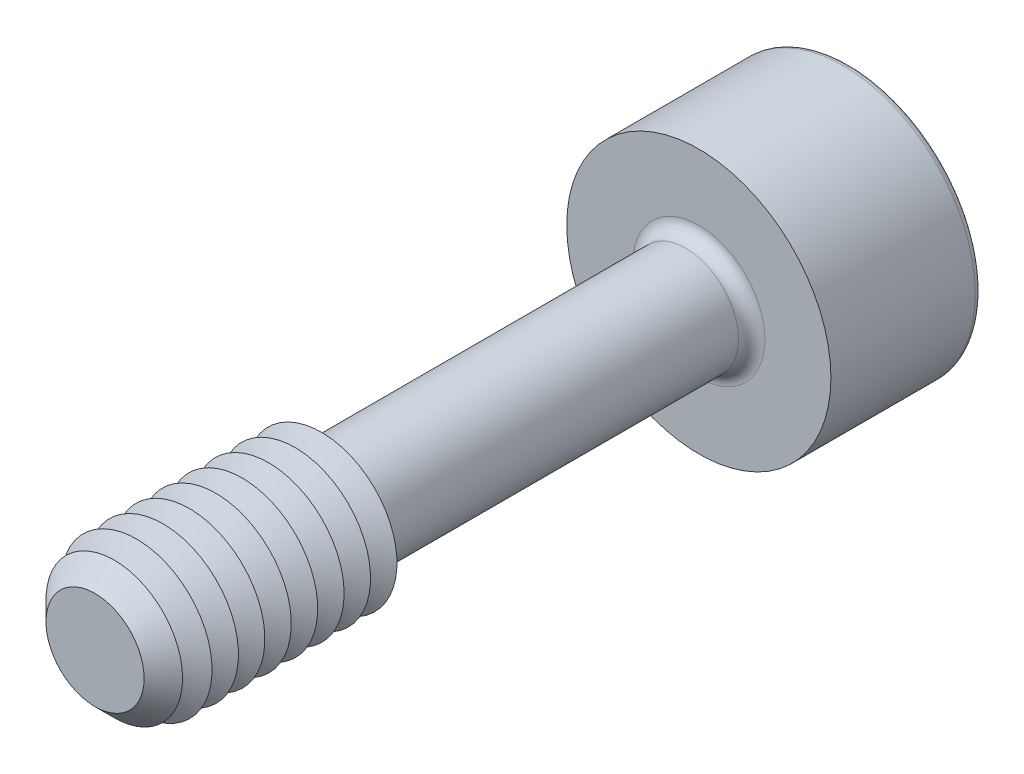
ISO-10303-21;
HEADER;
FILE_DESCRIPTION(('STEP AP214'),'2;1');
FILE_NAME('part.step','',(''),(''),'','','');
FILE_SCHEMA(('AUTOMOTIVE_DESIGN { 1 0 10303 214 1 1 1 1 }'));
ENDSEC;
DATA;
#1=APPLICATION_CONTEXT('core data for automotive mechanical design processes');
#2=APPLICATION_PROTOCOL_DEFINITION('international standard','automotive_design',2000,#1);
#3=PRODUCT_CONTEXT('',#1,'mechanical');
#4=PRODUCT('Part','Part','',(#3));
#5=PRODUCT_RELATED_PRODUCT_CATEGORY('part','',(#4));
#6=PRODUCT_DEFINITION_FORMATION('','',#4);
#7=PRODUCT_DEFINITION_CONTEXT('part definition',#1,'design');
#8=PRODUCT_DEFINITION('design','',#6,#7);
#9=PRODUCT_DEFINITION_SHAPE('','',#8);
#10=(LENGTH_UNIT() NAMED_UNIT(*) SI_UNIT(.MILLI.,.METRE.));
#11=(NAMED_UNIT(*) PLANE_ANGLE_UNIT() SI_UNIT($,.RADIAN.));
#12=(NAMED_UNIT(*) SI_UNIT($,.STERADIAN.) SOLID_ANGLE_UNIT());
#13=UNCERTAINTY_MEASURE_WITH_UNIT(LENGTH_MEASURE(1.E-05),#10,'distance_accuracy_value','');
#14=(GEOMETRIC_REPRESENTATION_CONTEXT(3) GLOBAL_UNCERTAINTY_ASSIGNED_CONTEXT((#13)) GLOBAL_UNIT_ASSIGNED_CONTEXT((#10,
#11,#12)) REPRESENTATION_CONTEXT('',''));
#15=CARTESIAN_POINT('',(0.,0.,0.));
#16=DIRECTION('',(0.,0.,1.));
#17=DIRECTION('',(1.,0.,0.));
#18=AXIS2_PLACEMENT_3D('',#15,#16,#17);
#19=CARTESIAN_POINT('',(-0.866025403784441,-1.5,-9.));
#20=DIRECTION('',(0.,0.,1.));
#21=DIRECTION('',(1.,0.,0.));
#22=AXIS2_PLACEMENT_3D('',#19,#20,#21);
#23=PLANE('',#22);
#24=DIRECTION('',(1.,0.,0.));
#25=VECTOR('',#24,1.);
#26=CARTESIAN_POINT('',(-0.866025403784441,-1.5,-9.));
#27=LINE('',#26,#25);
#28=CARTESIAN_POINT('',(0.,-1.5,-9.));
#29=VERTEX_POINT('',#28);
#30=CARTESIAN_POINT('',(0.866025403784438,-1.5,-9.));
#31=VERTEX_POINT('',#30);
#32=EDGE_CURVE('E762',#29,#31,#27,.T.);
#33=ORIENTED_EDGE('',*,*,#32,.F.);
#34=CARTESIAN_POINT('',(0.,0.,-9.));
#35=DIRECTION('',(0.,0.,1.));
#36=DIRECTION('',(0.,-1.,0.));
#37=AXIS2_PLACEMENT_3D('',#34,#35,#36);
#38=CIRCLE('',#37,1.5);
#39=CARTESIAN_POINT('',(1.29903810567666,-0.75,-9.));
#40=VERTEX_POINT('',#39);
#41=EDGE_CURVE('E53',#29,#40,#38,.T.);
#42=ORIENTED_EDGE('',*,*,#41,.T.);
#43=DIRECTION('',(0.5,0.866025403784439,0.));
#44=VECTOR('',#43,1.);
#45=CARTESIAN_POINT('',(0.866025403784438,-1.5,-9.));
#46=LINE('',#45,#44);
#47=EDGE_CURVE('E749',#31,#40,#46,.T.);
#48=ORIENTED_EDGE('',*,*,#47,.F.);
#49=EDGE_LOOP('',(#33,#42,#48));
#50=FACE_BOUND('',#49,.T.);
#51=ADVANCED_FACE('F41',(#50),#23,.F.);
#52=CARTESIAN_POINT('',(1.73205080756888,0.,-9.));
#53=VERTEX_POINT('',#52);
#54=EDGE_CURVE('E759',#40,#53,#46,.T.);
#55=ORIENTED_EDGE('',*,*,#54,.F.);
#56=CARTESIAN_POINT('',(1.29903810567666,0.749999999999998,-9.));
#57=VERTEX_POINT('',#56);
#58=EDGE_CURVE('E11',#40,#57,#38,.T.);
#59=ORIENTED_EDGE('',*,*,#58,.T.);
#60=DIRECTION('',(-0.5,0.866025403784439,0.));
#61=VECTOR('',#60,1.);
#62=CARTESIAN_POINT('',(1.73205080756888,0.,-9.));
#63=LINE('',#62,#61);
#64=EDGE_CURVE('E748',#53,#57,#63,.T.);
#65=ORIENTED_EDGE('',*,*,#64,.F.);
#66=EDGE_LOOP('',(#55,#59,#65));
#67=FACE_BOUND('',#66,.T.);
#68=ADVANCED_FACE('F133',(#67),#23,.F.);
#69=CARTESIAN_POINT('',(0.866025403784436,1.5,-9.));
#70=VERTEX_POINT('',#69);
#71=EDGE_CURVE('E743',#57,#70,#63,.T.);
#72=ORIENTED_EDGE('',*,*,#71,.F.);
#73=CARTESIAN_POINT('',(0.,1.5,-9.00000000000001));
#74=VERTEX_POINT('',#73);
#75=EDGE_CURVE('E51',#57,#74,#38,.T.);
#76=ORIENTED_EDGE('',*,*,#75,.T.);
#77=DIRECTION('',(-1.,0.,0.));
#78=VECTOR('',#77,1.);
#79=CARTESIAN_POINT('',(0.866025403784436,1.5,-9.));
#80=LINE('',#79,#78);
#81=EDGE_CURVE('E177',#70,#74,#80,.T.);
#82=ORIENTED_EDGE('',*,*,#81,.F.);
#83=EDGE_LOOP('',(#72,#76,#82));
#84=FACE_BOUND('',#83,.T.);
#85=ADVANCED_FACE('F139',(#84),#23,.F.);
#86=CARTESIAN_POINT('',(-0.866025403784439,1.5,-9.));
#87=VERTEX_POINT('',#86);
#88=EDGE_CURVE('E753',#74,#87,#80,.T.);
#89=ORIENTED_EDGE('',*,*,#88,.F.);
#90=CARTESIAN_POINT('',(-1.29903810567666,0.749999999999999,-9.));
#91=VERTEX_POINT('',#90);
#92=EDGE_CURVE('E266',#74,#91,#38,.T.);
#93=ORIENTED_EDGE('',*,*,#92,.T.);
#94=DIRECTION('',(-0.5,-0.866025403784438,0.));
#95=VECTOR('',#94,1.);
#96=CARTESIAN_POINT('',(-0.866025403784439,1.5,-9.));
#97=LINE('',#96,#95);
#98=EDGE_CURVE('E176',#87,#91,#97,.T.);
#99=ORIENTED_EDGE('',*,*,#98,.F.);
#100=EDGE_LOOP('',(#89,#93,#99));
#101=FACE_BOUND('',#100,.T.);
#102=ADVANCED_FACE('F157',(#101),#23,.F.);
#103=CARTESIAN_POINT('',(-1.73205080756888,0.,-9.));
#104=VERTEX_POINT('',#103);
#105=EDGE_CURVE('E170',#91,#104,#97,.T.);
#106=ORIENTED_EDGE('',*,*,#105,.F.);
#107=CARTESIAN_POINT('',(-1.29903810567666,-0.749999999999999,-9.));
#108=VERTEX_POINT('',#107);
#109=EDGE_CURVE('E172',#91,#108,#38,.T.);
#110=ORIENTED_EDGE('',*,*,#109,.T.);
#111=DIRECTION('',(0.5,-0.866025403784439,0.));
#112=VECTOR('',#111,1.);
#113=CARTESIAN_POINT('',(-1.73205080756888,0.,-9.));
#114=LINE('',#113,#112);
#115=EDGE_CURVE('E174',#104,#108,#114,.T.);
#116=ORIENTED_EDGE('',*,*,#115,.F.);
#117=EDGE_LOOP('',(#106,#110,#116));
#118=FACE_BOUND('',#117,.T.);
#119=ADVANCED_FACE('F146',(#118),#23,.F.);
#120=CARTESIAN_POINT('',(0.,0.,-12.));
#121=DIRECTION('',(0.,0.,-1.));
#122=DIRECTION('',(-1.,0.,0.));
#123=AXIS2_PLACEMENT_3D('',#120,#121,#122);
#124=PLANE('',#123);
#125=CARTESIAN_POINT('',(0.,0.,-12.));
#126=DIRECTION('',(0.,0.,-1.));
#127=DIRECTION('',(-1.,0.,0.));
#128=AXIS2_PLACEMENT_3D('',#125,#126,#127);
#129=CIRCLE('',#128,3.325);
#130=CARTESIAN_POINT('',(-3.325,0.,-12.));
#131=VERTEX_POINT('',#130);
#132=EDGE_CURVE('E250',#131,#131,#129,.T.);
#133=ORIENTED_EDGE('',*,*,#132,.T.);
#134=EDGE_LOOP('',(#133));
#135=FACE_BOUND('',#134,.T.);
#136=DIRECTION('',(-0.5,-0.866025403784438,0.));
#137=VECTOR('',#136,1.);
#138=CARTESIAN_POINT('',(-0.866025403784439,1.5,-12.));
#139=LINE('',#138,#137);
#140=CARTESIAN_POINT('',(-0.866025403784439,1.5,-12.));
#141=VERTEX_POINT('',#140);
#142=CARTESIAN_POINT('',(-1.73205080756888,0.,-12.));
#143=VERTEX_POINT('',#142);
#144=EDGE_CURVE('E212',#141,#143,#139,.T.);
#145=ORIENTED_EDGE('',*,*,#144,.T.);
#146=DIRECTION('',(0.5,-0.866025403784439,0.));
#147=VECTOR('',#146,1.);
#148=CARTESIAN_POINT('',(-1.73205080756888,0.,-12.));
#149=LINE('',#148,#147);
#150=CARTESIAN_POINT('',(-0.866025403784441,-1.5,-12.));
#151=VERTEX_POINT('',#150);
#152=EDGE_CURVE('E67',#143,#151,#149,.T.);
#153=ORIENTED_EDGE('',*,*,#152,.T.);
#154=DIRECTION('',(1.,0.,0.));
#155=VECTOR('',#154,1.);
#156=CARTESIAN_POINT('',(-0.866025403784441,-1.5,-12.));
#157=LINE('',#156,#155);
#158=CARTESIAN_POINT('',(0.866025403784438,-1.5,-12.));
#159=VERTEX_POINT('',#158);
#160=EDGE_CURVE('E196',#151,#159,#157,.T.);
#161=ORIENTED_EDGE('',*,*,#160,.T.);
#162=DIRECTION('',(0.5,0.866025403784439,0.));
#163=VECTOR('',#162,1.);
#164=CARTESIAN_POINT('',(0.866025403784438,-1.5,-12.));
#165=LINE('',#164,#163);
#166=CARTESIAN_POINT('',(1.73205080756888,0.,-12.));
#167=VERTEX_POINT('',#166);
#168=EDGE_CURVE('E200',#159,#167,#165,.T.);
#169=ORIENTED_EDGE('',*,*,#168,.T.);
#170=DIRECTION('',(-0.5,0.866025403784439,0.));
#171=VECTOR('',#170,1.);
#172=CARTESIAN_POINT('',(1.73205080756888,0.,-12.));
#173=LINE('',#172,#171);
#174=CARTESIAN_POINT('',(0.866025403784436,1.5,-12.));
#175=VERTEX_POINT('',#174);
#176=EDGE_CURVE('E204',#167,#175,#173,.T.);
#177=ORIENTED_EDGE('',*,*,#176,.T.);
#178=DIRECTION('',(-1.,0.,0.));
#179=VECTOR('',#178,1.);
#180=CARTESIAN_POINT('',(0.866025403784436,1.5,-12.));
#181=LINE('',#180,#179);
#182=EDGE_CURVE('E208',#175,#141,#181,.T.);
#183=ORIENTED_EDGE('',*,*,#182,.T.);
#184=EDGE_LOOP('',(#145,#153,#161,#169,#177,#183));
#185=FACE_BOUND('',#184,.T.);
#186=ADVANCED_FACE('F156',(#135,#185),#124,.T.);
#187=CARTESIAN_POINT('',(0.,0.,8.));
#188=DIRECTION('',(0.,0.,-1.));
#189=DIRECTION('',(-1.,0.,0.));
#190=AXIS2_PLACEMENT_3D('',#187,#188,#189);
#191=CYLINDRICAL_SURFACE('',#190,1.4);
#192=CARTESIAN_POINT('',(0.,0.,-7.65));
#193=DIRECTION('',(0.,0.,-1.));
#194=DIRECTION('',(-1.,0.,0.));
#195=AXIS2_PLACEMENT_3D('',#192,#193,#194);
#196=CIRCLE('',#195,1.4);
#197=CARTESIAN_POINT('',(-1.4,0.,-7.65));
#198=VERTEX_POINT('',#197);
#199=EDGE_CURVE('E246',#198,#198,#196,.F.);
#200=ORIENTED_EDGE('',*,*,#199,.T.);
#201=EDGE_LOOP('',(#200));
#202=FACE_BOUND('',#201,.T.);
#203=CARTESIAN_POINT('',(0.,0.,1.65358983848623));
#204=DIRECTION('',(0.,0.,-1.));
#205=DIRECTION('',(0.,1.,0.));
#206=AXIS2_PLACEMENT_3D('',#203,#204,#205);
#207=CIRCLE('',#206,1.4);
#208=CARTESIAN_POINT('',(0.,1.4,1.65358983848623));
#209=VERTEX_POINT('',#208);
#210=EDGE_CURVE('E234',#209,#209,#207,.T.);
#211=ORIENTED_EDGE('',*,*,#210,.T.);
#212=EDGE_LOOP('',(#211));
#213=FACE_BOUND('',#212,.T.);
#214=ADVANCED_FACE('F163',(#202,#213),#191,.T.);
#215=CARTESIAN_POINT('',(0.,0.,1.65358983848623));
#216=DIRECTION('',(0.,0.,1.));
#217=DIRECTION('',(0.,-1.,0.));
#218=AXIS2_PLACEMENT_3D('',#215,#216,#217);
#219=CONICAL_SURFACE('',#218,1.4,1.0471975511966);
#220=CARTESIAN_POINT('',(0.,0.,2.));
#221=DIRECTION('',(0.,0.,-1.));
#222=DIRECTION('',(-1.,0.,0.));
#223=AXIS2_PLACEMENT_3D('',#220,#221,#222);
#224=CIRCLE('',#223,2.);
#225=CARTESIAN_POINT('',(-2.,0.,2.));
#226=VERTEX_POINT('',#225);
#227=EDGE_CURVE('E270',#226,#226,#224,.T.);
#228=ORIENTED_EDGE('',*,*,#227,.T.);
#229=EDGE_LOOP('',(#228));
#230=FACE_BOUND('',#229,.T.);
#231=ORIENTED_EDGE('',*,*,#210,.F.);
#232=EDGE_LOOP('',(#231));
#233=FACE_BOUND('',#232,.T.);
#234=ADVANCED_FACE('F512',(#230,#233),#219,.T.);
#235=CARTESIAN_POINT('',(0.,0.,-8.));
#236=DIRECTION('',(0.,0.,-1.));
#237=DIRECTION('',(-1.,0.,0.));
#238=AXIS2_PLACEMENT_3D('',#235,#236,#237);
#239=PLANE('',#238);
#240=CARTESIAN_POINT('',(0.,0.,-8.));
#241=DIRECTION('',(0.,0.,-1.));
#242=DIRECTION('',(-1.,0.,0.));
#243=AXIS2_PLACEMENT_3D('',#240,#241,#242);
#244=CIRCLE('',#243,1.75);
#245=CARTESIAN_POINT('',(-1.75,0.,-8.));
#246=VERTEX_POINT('',#245);
#247=EDGE_CURVE('E242',#246,#246,#244,.T.);
#248=ORIENTED_EDGE('',*,*,#247,.T.);
#249=EDGE_LOOP('',(#248));
#250=FACE_BOUND('',#249,.T.);
#251=CARTESIAN_POINT('',(0.,0.,-8.));
#252=DIRECTION('',(0.,0.,-1.));
#253=DIRECTION('',(-1.,0.,0.));
#254=AXIS2_PLACEMENT_3D('',#251,#252,#253);
#255=CIRCLE('',#254,3.5);
#256=CARTESIAN_POINT('',(-3.5,0.,-8.));
#257=VERTEX_POINT('',#256);
#258=EDGE_CURVE('E230',#257,#257,#255,.T.);
#259=ORIENTED_EDGE('',*,*,#258,.F.);
#260=EDGE_LOOP('',(#259));
#261=FACE_BOUND('',#260,.T.);
#262=ADVANCED_FACE('F505',(#250,#261),#239,.F.);
#263=CARTESIAN_POINT('',(0.,0.,-12.));
#264=DIRECTION('',(0.,0.,1.));
#265=DIRECTION('',(1.,0.,0.));
#266=AXIS2_PLACEMENT_3D('',#263,#264,#265);
#267=CYLINDRICAL_SURFACE('',#266,3.5);
#268=CARTESIAN_POINT('',(0.,0.,-11.825));
#269=DIRECTION('',(0.,0.,-1.));
#270=DIRECTION('',(-1.,0.,0.));
#271=AXIS2_PLACEMENT_3D('',#268,#269,#270);
#272=CIRCLE('',#271,3.5);
#273=CARTESIAN_POINT('',(-3.5,0.,-11.825));
#274=VERTEX_POINT('',#273);
#275=EDGE_CURVE('E253',#274,#274,#272,.F.);
#276=ORIENTED_EDGE('',*,*,#275,.T.);
#277=EDGE_LOOP('',(#276));
#278=FACE_BOUND('',#277,.T.);
#279=ORIENTED_EDGE('',*,*,#258,.T.);
#280=EDGE_LOOP('',(#279));
#281=FACE_BOUND('',#280,.T.);
#282=ADVANCED_FACE('F511',(#278,#281),#267,.T.);
#283=CARTESIAN_POINT('',(-1.73205080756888,0.,-9.));
#284=DIRECTION('',(0.866025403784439,0.5,0.));
#285=DIRECTION('',(-0.5,0.866025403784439,0.));
#286=AXIS2_PLACEMENT_3D('',#283,#284,#285);
#287=PLANE('',#286);
#288=ORIENTED_EDGE('',*,*,#152,.F.);
#289=DIRECTION('',(0.,0.,-1.));
#290=VECTOR('',#289,1.);
#291=CARTESIAN_POINT('',(-1.73205080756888,0.,-9.));
#292=LINE('',#291,#290);
#293=EDGE_CURVE('E186',#104,#143,#292,.T.);
#294=ORIENTED_EDGE('',*,*,#293,.F.);
#295=ORIENTED_EDGE('',*,*,#115,.T.);
#296=CARTESIAN_POINT('',(-0.866025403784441,-1.5,-9.));
#297=VERTEX_POINT('',#296);
#298=EDGE_CURVE('E215',#108,#297,#114,.T.);
#299=ORIENTED_EDGE('',*,*,#298,.T.);
#300=DIRECTION('',(0.,0.,-1.));
#301=VECTOR('',#300,1.);
#302=CARTESIAN_POINT('',(-0.866025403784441,-1.5,-9.));
#303=LINE('',#302,#301);
#304=EDGE_CURVE('E227',#297,#151,#303,.T.);
#305=ORIENTED_EDGE('',*,*,#304,.T.);
#306=EDGE_LOOP('',(#288,#294,#295,#299,#305));
#307=FACE_BOUND('',#306,.T.);
#308=ADVANCED_FACE('F523',(#307),#287,.T.);
#309=CARTESIAN_POINT('',(-0.866025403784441,-1.5,-9.));
#310=DIRECTION('',(0.,1.,0.));
#311=DIRECTION('',(0.,0.,1.));
#312=AXIS2_PLACEMENT_3D('',#309,#310,#311);
#313=PLANE('',#312);
#314=ORIENTED_EDGE('',*,*,#160,.F.);
#315=ORIENTED_EDGE('',*,*,#304,.F.);
#316=EDGE_CURVE('E760',#297,#29,#27,.T.);
#317=ORIENTED_EDGE('',*,*,#316,.T.);
#318=ORIENTED_EDGE('',*,*,#32,.T.);
#319=DIRECTION('',(0.,0.,-1.));
#320=VECTOR('',#319,1.);
#321=CARTESIAN_POINT('',(0.866025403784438,-1.5,-9.));
#322=LINE('',#321,#320);
#323=EDGE_CURVE('E224',#31,#159,#322,.T.);
#324=ORIENTED_EDGE('',*,*,#323,.T.);
#325=EDGE_LOOP('',(#314,#315,#317,#318,#324));
#326=FACE_BOUND('',#325,.T.);
#327=ADVANCED_FACE('F539',(#326),#313,.T.);
#328=CARTESIAN_POINT('',(0.866025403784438,-1.5,-9.));
#329=DIRECTION('',(-0.866025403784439,0.5,0.));
#330=DIRECTION('',(-0.5,-0.866025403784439,0.));
#331=AXIS2_PLACEMENT_3D('',#328,#329,#330);
#332=PLANE('',#331);
#333=ORIENTED_EDGE('',*,*,#168,.F.);
#334=ORIENTED_EDGE('',*,*,#323,.F.);
#335=ORIENTED_EDGE('',*,*,#47,.T.);
#336=ORIENTED_EDGE('',*,*,#54,.T.);
#337=DIRECTION('',(0.,0.,-1.));
#338=VECTOR('',#337,1.);
#339=CARTESIAN_POINT('',(1.73205080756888,0.,-9.));
#340=LINE('',#339,#338);
#341=EDGE_CURVE('E221',#53,#167,#340,.T.);
#342=ORIENTED_EDGE('',*,*,#341,.T.);
#343=EDGE_LOOP('',(#333,#334,#335,#336,#342));
#344=FACE_BOUND('',#343,.T.);
#345=ADVANCED_FACE('F549',(#344),#332,.T.);
#346=CARTESIAN_POINT('',(1.73205080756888,0.,-9.));
#347=DIRECTION('',(-0.866025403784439,-0.5,0.));
#348=DIRECTION('',(0.5,-0.866025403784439,0.));
#349=AXIS2_PLACEMENT_3D('',#346,#347,#348);
#350=PLANE('',#349);
#351=ORIENTED_EDGE('',*,*,#176,.F.);
#352=ORIENTED_EDGE('',*,*,#341,.F.);
#353=ORIENTED_EDGE('',*,*,#64,.T.);
#354=ORIENTED_EDGE('',*,*,#71,.T.);
#355=DIRECTION('',(0.,0.,-1.));
#356=VECTOR('',#355,1.);
#357=CARTESIAN_POINT('',(0.866025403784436,1.5,-9.));
#358=LINE('',#357,#356);
#359=EDGE_CURVE('E218',#70,#175,#358,.T.);
#360=ORIENTED_EDGE('',*,*,#359,.T.);
#361=EDGE_LOOP('',(#351,#352,#353,#354,#360));
#362=FACE_BOUND('',#361,.T.);
#363=ADVANCED_FACE('F559',(#362),#350,.T.);
#364=CARTESIAN_POINT('',(0.866025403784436,1.5,-9.));
#365=DIRECTION('',(0.,-1.,0.));
#366=DIRECTION('',(0.,0.,-1.));
#367=AXIS2_PLACEMENT_3D('',#364,#365,#366);
#368=PLANE('',#367);
#369=ORIENTED_EDGE('',*,*,#182,.F.);
#370=ORIENTED_EDGE('',*,*,#359,.F.);
#371=ORIENTED_EDGE('',*,*,#81,.T.);
#372=ORIENTED_EDGE('',*,*,#88,.T.);
#373=DIRECTION('',(0.,0.,-1.));
#374=VECTOR('',#373,1.);
#375=CARTESIAN_POINT('',(-0.866025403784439,1.5,-9.));
#376=LINE('',#375,#374);
#377=EDGE_CURVE('E182',#87,#141,#376,.T.);
#378=ORIENTED_EDGE('',*,*,#377,.T.);
#379=EDGE_LOOP('',(#369,#370,#371,#372,#378));
#380=FACE_BOUND('',#379,.T.);
#381=ADVANCED_FACE('F152',(#380),#368,.T.);
#382=CARTESIAN_POINT('',(-0.866025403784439,1.5,-9.));
#383=DIRECTION('',(0.866025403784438,-0.5,0.));
#384=DIRECTION('',(0.5,0.866025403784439,0.));
#385=AXIS2_PLACEMENT_3D('',#382,#383,#384);
#386=PLANE('',#385);
#387=ORIENTED_EDGE('',*,*,#144,.F.);
#388=ORIENTED_EDGE('',*,*,#377,.F.);
#389=ORIENTED_EDGE('',*,*,#98,.T.);
#390=ORIENTED_EDGE('',*,*,#105,.T.);
#391=ORIENTED_EDGE('',*,*,#293,.T.);
#392=EDGE_LOOP('',(#387,#388,#389,#390,#391));
#393=FACE_BOUND('',#392,.T.);
#394=ADVANCED_FACE('F144',(#393),#386,.T.);
#395=ORIENTED_EDGE('',*,*,#298,.F.);
#396=EDGE_CURVE('E256',#108,#29,#38,.T.);
#397=ORIENTED_EDGE('',*,*,#396,.T.);
#398=ORIENTED_EDGE('',*,*,#316,.F.);
#399=EDGE_LOOP('',(#395,#397,#398));
#400=FACE_BOUND('',#399,.T.);
#401=ADVANCED_FACE('F135',(#400),#23,.F.);
#402=CARTESIAN_POINT('',(0.,0.,-7.65));
#403=DIRECTION('',(0.,0.,-1.));
#404=DIRECTION('',(-1.,0.,0.));
#405=AXIS2_PLACEMENT_3D('',#402,#403,#404);
#406=TOROIDAL_SURFACE('',#405,1.75,0.35);
#407=ORIENTED_EDGE('',*,*,#199,.F.);
#408=EDGE_LOOP('',(#407));
#409=FACE_BOUND('',#408,.T.);
#410=ORIENTED_EDGE('',*,*,#247,.F.);
#411=EDGE_LOOP('',(#410));
#412=FACE_BOUND('',#411,.T.);
#413=ADVANCED_FACE('F129',(#409,#412),#406,.F.);
#414=CARTESIAN_POINT('',(0.,0.,-11.825));
#415=DIRECTION('',(0.,0.,-1.));
#416=DIRECTION('',(-1.,0.,0.));
#417=AXIS2_PLACEMENT_3D('',#414,#415,#416);
#418=TOROIDAL_SURFACE('',#417,3.325,0.175);
#419=ORIENTED_EDGE('',*,*,#275,.F.);
#420=EDGE_LOOP('',(#419));
#421=FACE_BOUND('',#420,.T.);
#422=ORIENTED_EDGE('',*,*,#132,.F.);
#423=EDGE_LOOP('',(#422));
#424=FACE_BOUND('',#423,.T.);
#425=ADVANCED_FACE('F43',(#421,#424),#418,.T.);
#426=CARTESIAN_POINT('',(0.,0.,-8.13397459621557));
#427=DIRECTION('',(0.,0.,-1.));
#428=DIRECTION('',(0.,1.,0.));
#429=AXIS2_PLACEMENT_3D('',#426,#427,#428);
#430=CONICAL_SURFACE('',#429,0.,1.0471975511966);
#431=ORIENTED_EDGE('',*,*,#41,.F.);
#432=ORIENTED_EDGE('',*,*,#396,.F.);
#433=ORIENTED_EDGE('',*,*,#109,.F.);
#434=ORIENTED_EDGE('',*,*,#92,.F.);
#435=ORIENTED_EDGE('',*,*,#75,.F.);
#436=ORIENTED_EDGE('',*,*,#58,.F.);
#437=EDGE_LOOP('',(#431,#432,#433,#434,#435,#436));
#438=FACE_BOUND('',#437,.T.);
#439=CARTESIAN_POINT('',(0.,0.,-8.13397459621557));
#440=VERTEX_POINT('',#439);
#441=VERTEX_LOOP('',#440);
#442=FACE_BOUND('',#441,.T.);
#443=ADVANCED_FACE('F118',(#438,#442),#430,.F.);
#444=CARTESIAN_POINT('',(0.,0.,2.35));
#445=DIRECTION('',(0.,0.,-1.));
#446=DIRECTION('',(-1.,0.,0.));
#447=AXIS2_PLACEMENT_3D('',#444,#445,#446);
#448=CONICAL_SURFACE('',#447,1.39378221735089,1.0471975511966);
#449=ORIENTED_EDGE('',*,*,#227,.F.);
#450=EDGE_LOOP('',(#449));
#451=FACE_BOUND('',#450,.T.);
#452=CARTESIAN_POINT('',(0.,0.,2.35));
#453=DIRECTION('',(0.,0.,-1.));
#454=DIRECTION('',(-1.,0.,0.));
#455=AXIS2_PLACEMENT_3D('',#452,#453,#454);
#456=CIRCLE('',#455,1.39378221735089);
#457=CARTESIAN_POINT('',(-1.39378221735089,0.,2.35));
#458=VERTEX_POINT('',#457);
#459=EDGE_CURVE('E277',#458,#458,#456,.T.);
#460=ORIENTED_EDGE('',*,*,#459,.T.);
#461=EDGE_LOOP('',(#460));
#462=FACE_BOUND('',#461,.T.);
#463=ADVANCED_FACE('F120',(#451,#462),#448,.T.);
#464=CARTESIAN_POINT('',(0.,0.,2.7));
#465=DIRECTION('',(0.,0.,1.));
#466=DIRECTION('',(1.,0.,0.));
#467=AXIS2_PLACEMENT_3D('',#464,#465,#466);
#468=CONICAL_SURFACE('',#467,2.,1.0471975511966);
#469=ORIENTED_EDGE('',*,*,#459,.F.);
#470=EDGE_LOOP('',(#469));
#471=FACE_BOUND('',#470,.T.);
#472=CARTESIAN_POINT('',(0.,0.,2.7));
#473=DIRECTION('',(0.,0.,-1.));
#474=DIRECTION('',(-1.,0.,0.));
#475=AXIS2_PLACEMENT_3D('',#472,#473,#474);
#476=CIRCLE('',#475,2.);
#477=CARTESIAN_POINT('',(-2.,0.,2.7));
#478=VERTEX_POINT('',#477);
#479=EDGE_CURVE('E283',#478,#478,#476,.T.);
#480=ORIENTED_EDGE('',*,*,#479,.T.);
#481=EDGE_LOOP('',(#480));
#482=FACE_BOUND('',#481,.T.);
#483=ADVANCED_FACE('F126',(#471,#482),#468,.T.);
#484=CARTESIAN_POINT('',(0.,0.,3.05));
#485=DIRECTION('',(0.,0.,-1.));
#486=DIRECTION('',(-1.,0.,0.));
#487=AXIS2_PLACEMENT_3D('',#484,#485,#486);
#488=CONICAL_SURFACE('',#487,1.39378221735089,1.0471975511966);
#489=ORIENTED_EDGE('',*,*,#479,.F.);
#490=EDGE_LOOP('',(#489));
#491=FACE_BOUND('',#490,.T.);
#492=CARTESIAN_POINT('',(0.,0.,3.05));
#493=DIRECTION('',(0.,0.,-1.));
#494=DIRECTION('',(-1.,0.,0.));
#495=AXIS2_PLACEMENT_3D('',#492,#493,#494);
#496=CIRCLE('',#495,1.39378221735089);
#497=CARTESIAN_POINT('',(-1.39378221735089,0.,3.05));
#498=VERTEX_POINT('',#497);
#499=EDGE_CURVE('E289',#498,#498,#496,.T.);
#500=ORIENTED_EDGE('',*,*,#499,.T.);
#501=EDGE_LOOP('',(#500));
#502=FACE_BOUND('',#501,.T.);
#503=ADVANCED_FACE('F399',(#491,#502),#488,.T.);
#504=CARTESIAN_POINT('',(0.,0.,3.4));
#505=DIRECTION('',(0.,0.,1.));
#506=DIRECTION('',(1.,0.,0.));
#507=AXIS2_PLACEMENT_3D('',#504,#505,#506);
#508=CONICAL_SURFACE('',#507,2.,1.0471975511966);
#509=ORIENTED_EDGE('',*,*,#499,.F.);
#510=EDGE_LOOP('',(#509));
#511=FACE_BOUND('',#510,.T.);
#512=CARTESIAN_POINT('',(0.,0.,3.4));
#513=DIRECTION('',(0.,0.,-1.));
#514=DIRECTION('',(-1.,0.,0.));
#515=AXIS2_PLACEMENT_3D('',#512,#513,#514);
#516=CIRCLE('',#515,2.);
#517=CARTESIAN_POINT('',(-2.,0.,3.4));
#518=VERTEX_POINT('',#517);
#519=EDGE_CURVE('E293',#518,#518,#516,.T.);
#520=ORIENTED_EDGE('',*,*,#519,.T.);
#521=EDGE_LOOP('',(#520));
#522=FACE_BOUND('',#521,.T.);
#523=ADVANCED_FACE('F395',(#511,#522),#508,.T.);
#524=CARTESIAN_POINT('',(0.,0.,3.75));
#525=DIRECTION('',(0.,0.,-1.));
#526=DIRECTION('',(-1.,0.,0.));
#527=AXIS2_PLACEMENT_3D('',#524,#525,#526);
#528=CONICAL_SURFACE('',#527,1.39378221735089,1.0471975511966);
#529=ORIENTED_EDGE('',*,*,#519,.F.);
#530=EDGE_LOOP('',(#529));
#531=FACE_BOUND('',#530,.T.);
#532=CARTESIAN_POINT('',(0.,0.,3.75));
#533=DIRECTION('',(0.,0.,-1.));
#534=DIRECTION('',(-1.,0.,0.));
#535=AXIS2_PLACEMENT_3D('',#532,#533,#534);
#536=CIRCLE('',#535,1.39378221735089);
#537=CARTESIAN_POINT('',(-1.39378221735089,0.,3.75));
#538=VERTEX_POINT('',#537);
#539=EDGE_CURVE('E297',#538,#538,#536,.T.);
#540=ORIENTED_EDGE('',*,*,#539,.T.);
#541=EDGE_LOOP('',(#540));
#542=FACE_BOUND('',#541,.T.);
#543=ADVANCED_FACE('F391',(#531,#542),#528,.T.);
#544=CARTESIAN_POINT('',(0.,0.,4.1));
#545=DIRECTION('',(0.,0.,1.));
#546=DIRECTION('',(1.,0.,0.));
#547=AXIS2_PLACEMENT_3D('',#544,#545,#546);
#548=CONICAL_SURFACE('',#547,2.,1.0471975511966);
#549=ORIENTED_EDGE('',*,*,#539,.F.);
#550=EDGE_LOOP('',(#549));
#551=FACE_BOUND('',#550,.T.);
#552=CARTESIAN_POINT('',(0.,0.,4.1));
#553=DIRECTION('',(0.,0.,-1.));
#554=DIRECTION('',(-1.,0.,0.));
#555=AXIS2_PLACEMENT_3D('',#552,#553,#554);
#556=CIRCLE('',#555,2.);
#557=CARTESIAN_POINT('',(-2.,0.,4.1));
#558=VERTEX_POINT('',#557);
#559=EDGE_CURVE('E300',#558,#558,#556,.T.);
#560=ORIENTED_EDGE('',*,*,#559,.T.);
#561=EDGE_LOOP('',(#560));
#562=FACE_BOUND('',#561,.T.);
#563=ADVANCED_FACE('F387',(#551,#562),#548,.T.);
#564=CARTESIAN_POINT('',(0.,0.,4.45));
#565=DIRECTION('',(0.,0.,-1.));
#566=DIRECTION('',(-1.,0.,0.));
#567=AXIS2_PLACEMENT_3D('',#564,#565,#566);
#568=CONICAL_SURFACE('',#567,1.39378221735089,1.0471975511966);
#569=ORIENTED_EDGE('',*,*,#559,.F.);
#570=EDGE_LOOP('',(#569));
#571=FACE_BOUND('',#570,.T.);
#572=CARTESIAN_POINT('',(0.,0.,4.45));
#573=DIRECTION('',(0.,0.,-1.));
#574=DIRECTION('',(-1.,0.,0.));
#575=AXIS2_PLACEMENT_3D('',#572,#573,#574);
#576=CIRCLE('',#575,1.39378221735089);
#577=CARTESIAN_POINT('',(-1.39378221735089,0.,4.45));
#578=VERTEX_POINT('',#577);
#579=EDGE_CURVE('E304',#578,#578,#576,.T.);
#580=ORIENTED_EDGE('',*,*,#579,.T.);
#581=EDGE_LOOP('',(#580));
#582=FACE_BOUND('',#581,.T.);
#583=ADVANCED_FACE('F383',(#571,#582),#568,.T.);
#584=CARTESIAN_POINT('',(0.,0.,4.8));
#585=DIRECTION('',(0.,0.,1.));
#586=DIRECTION('',(1.,0.,0.));
#587=AXIS2_PLACEMENT_3D('',#584,#585,#586);
#588=CONICAL_SURFACE('',#587,2.,1.0471975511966);
#589=ORIENTED_EDGE('',*,*,#579,.F.);
#590=EDGE_LOOP('',(#589));
#591=FACE_BOUND('',#590,.T.);
#592=CARTESIAN_POINT('',(0.,0.,4.8));
#593=DIRECTION('',(0.,0.,-1.));
#594=DIRECTION('',(-1.,0.,0.));
#595=AXIS2_PLACEMENT_3D('',#592,#593,#594);
#596=CIRCLE('',#595,2.);
#597=CARTESIAN_POINT('',(-2.,0.,4.8));
#598=VERTEX_POINT('',#597);
#599=EDGE_CURVE('E308',#598,#598,#596,.T.);
#600=ORIENTED_EDGE('',*,*,#599,.T.);
#601=EDGE_LOOP('',(#600));
#602=FACE_BOUND('',#601,.T.);
#603=ADVANCED_FACE('F379',(#591,#602),#588,.T.);
#604=CARTESIAN_POINT('',(0.,0.,5.15));
#605=DIRECTION('',(0.,0.,-1.));
#606=DIRECTION('',(-1.,0.,0.));
#607=AXIS2_PLACEMENT_3D('',#604,#605,#606);
#608=CONICAL_SURFACE('',#607,1.39378221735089,1.0471975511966);
#609=ORIENTED_EDGE('',*,*,#599,.F.);
#610=EDGE_LOOP('',(#609));
#611=FACE_BOUND('',#610,.T.);
#612=CARTESIAN_POINT('',(0.,0.,5.15));
#613=DIRECTION('',(0.,0.,-1.));
#614=DIRECTION('',(-1.,0.,0.));
#615=AXIS2_PLACEMENT_3D('',#612,#613,#614);
#616=CIRCLE('',#615,1.39378221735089);
#617=CARTESIAN_POINT('',(-1.39378221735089,0.,5.15));
#618=VERTEX_POINT('',#617);
#619=EDGE_CURVE('E312',#618,#618,#616,.T.);
#620=ORIENTED_EDGE('',*,*,#619,.T.);
#621=EDGE_LOOP('',(#620));
#622=FACE_BOUND('',#621,.T.);
#623=ADVANCED_FACE('F375',(#611,#622),#608,.T.);
#624=CARTESIAN_POINT('',(0.,0.,5.5));
#625=DIRECTION('',(0.,0.,1.));
#626=DIRECTION('',(1.,0.,0.));
#627=AXIS2_PLACEMENT_3D('',#624,#625,#626);
#628=CONICAL_SURFACE('',#627,2.,1.0471975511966);
#629=ORIENTED_EDGE('',*,*,#619,.F.);
#630=EDGE_LOOP('',(#629));
#631=FACE_BOUND('',#630,.T.);
#632=CARTESIAN_POINT('',(0.,0.,5.5));
#633=DIRECTION('',(0.,0.,-1.));
#634=DIRECTION('',(-1.,0.,0.));
#635=AXIS2_PLACEMENT_3D('',#632,#633,#634);
#636=CIRCLE('',#635,2.);
#637=CARTESIAN_POINT('',(-2.,0.,5.5));
#638=VERTEX_POINT('',#637);
#639=EDGE_CURVE('E315',#638,#638,#636,.T.);
#640=ORIENTED_EDGE('',*,*,#639,.T.);
#641=EDGE_LOOP('',(#640));
#642=FACE_BOUND('',#641,.T.);
#643=ADVANCED_FACE('F371',(#631,#642),#628,.T.);
#644=CARTESIAN_POINT('',(0.,0.,5.85));
#645=DIRECTION('',(0.,0.,-1.));
#646=DIRECTION('',(-1.,0.,0.));
#647=AXIS2_PLACEMENT_3D('',#644,#645,#646);
#648=CONICAL_SURFACE('',#647,1.39378221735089,1.0471975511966);
#649=ORIENTED_EDGE('',*,*,#639,.F.);
#650=EDGE_LOOP('',(#649));
#651=FACE_BOUND('',#650,.T.);
#652=CARTESIAN_POINT('',(0.,0.,5.85));
#653=DIRECTION('',(0.,0.,-1.));
#654=DIRECTION('',(-1.,0.,0.));
#655=AXIS2_PLACEMENT_3D('',#652,#653,#654);
#656=CIRCLE('',#655,1.39378221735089);
#657=CARTESIAN_POINT('',(-1.39378221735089,0.,5.85));
#658=VERTEX_POINT('',#657);
#659=EDGE_CURVE('E319',#658,#658,#656,.T.);
#660=ORIENTED_EDGE('',*,*,#659,.T.);
#661=EDGE_LOOP('',(#660));
#662=FACE_BOUND('',#661,.T.);
#663=ADVANCED_FACE('F367',(#651,#662),#648,.T.);
#664=CARTESIAN_POINT('',(0.,0.,6.2));
#665=DIRECTION('',(0.,0.,1.));
#666=DIRECTION('',(1.,0.,0.));
#667=AXIS2_PLACEMENT_3D('',#664,#665,#666);
#668=CONICAL_SURFACE('',#667,2.,1.0471975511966);
#669=ORIENTED_EDGE('',*,*,#659,.F.);
#670=EDGE_LOOP('',(#669));
#671=FACE_BOUND('',#670,.T.);
#672=CARTESIAN_POINT('',(0.,0.,6.2));
#673=DIRECTION('',(0.,0.,-1.));
#674=DIRECTION('',(-1.,0.,0.));
#675=AXIS2_PLACEMENT_3D('',#672,#673,#674);
#676=CIRCLE('',#675,2.);
#677=CARTESIAN_POINT('',(-2.,0.,6.2));
#678=VERTEX_POINT('',#677);
#679=EDGE_CURVE('E322',#678,#678,#676,.T.);
#680=ORIENTED_EDGE('',*,*,#679,.T.);
#681=EDGE_LOOP('',(#680));
#682=FACE_BOUND('',#681,.T.);
#683=ADVANCED_FACE('F363',(#671,#682),#668,.T.);
#684=CARTESIAN_POINT('',(0.,0.,6.55));
#685=DIRECTION('',(0.,0.,-1.));
#686=DIRECTION('',(-1.,0.,0.));
#687=AXIS2_PLACEMENT_3D('',#684,#685,#686);
#688=CONICAL_SURFACE('',#687,1.39378221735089,1.0471975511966);
#689=ORIENTED_EDGE('',*,*,#679,.F.);
#690=EDGE_LOOP('',(#689));
#691=FACE_BOUND('',#690,.T.);
#692=CARTESIAN_POINT('',(0.,0.,6.55));
#693=DIRECTION('',(0.,0.,-1.));
#694=DIRECTION('',(-1.,0.,0.));
#695=AXIS2_PLACEMENT_3D('',#692,#693,#694);
#696=CIRCLE('',#695,1.39378221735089);
#697=CARTESIAN_POINT('',(-1.39378221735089,0.,6.55));
#698=VERTEX_POINT('',#697);
#699=EDGE_CURVE('E325',#698,#698,#696,.T.);
#700=ORIENTED_EDGE('',*,*,#699,.T.);
#701=EDGE_LOOP('',(#700));
#702=FACE_BOUND('',#701,.T.);
#703=ADVANCED_FACE('F359',(#691,#702),#688,.T.);
#704=CARTESIAN_POINT('',(0.,0.,6.9));
#705=DIRECTION('',(0.,0.,1.));
#706=DIRECTION('',(1.,0.,0.));
#707=AXIS2_PLACEMENT_3D('',#704,#705,#706);
#708=CONICAL_SURFACE('',#707,2.,1.0471975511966);
#709=ORIENTED_EDGE('',*,*,#699,.F.);
#710=EDGE_LOOP('',(#709));
#711=FACE_BOUND('',#710,.T.);
#712=CARTESIAN_POINT('',(0.,0.,6.9));
#713=DIRECTION('',(0.,0.,-1.));
#714=DIRECTION('',(-1.,0.,0.));
#715=AXIS2_PLACEMENT_3D('',#712,#713,#714);
#716=CIRCLE('',#715,2.);
#717=CARTESIAN_POINT('',(-2.,0.,6.9));
#718=VERTEX_POINT('',#717);
#719=EDGE_CURVE('E328',#718,#718,#716,.T.);
#720=ORIENTED_EDGE('',*,*,#719,.T.);
#721=EDGE_LOOP('',(#720));
#722=FACE_BOUND('',#721,.T.);
#723=ADVANCED_FACE('F352',(#711,#722),#708,.T.);
#724=CARTESIAN_POINT('',(0.,0.,7.25));
#725=DIRECTION('',(0.,0.,-1.));
#726=DIRECTION('',(-1.,0.,0.));
#727=AXIS2_PLACEMENT_3D('',#724,#725,#726);
#728=CONICAL_SURFACE('',#727,1.39378221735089,1.0471975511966);
#729=ORIENTED_EDGE('',*,*,#719,.F.);
#730=EDGE_LOOP('',(#729));
#731=FACE_BOUND('',#730,.T.);
#732=CARTESIAN_POINT('',(0.,0.,7.25));
#733=DIRECTION('',(0.,0.,-1.));
#734=DIRECTION('',(-1.,0.,0.));
#735=AXIS2_PLACEMENT_3D('',#732,#733,#734);
#736=CIRCLE('',#735,1.39378221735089);
#737=CARTESIAN_POINT('',(-1.39378221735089,0.,7.25));
#738=VERTEX_POINT('',#737);
#739=EDGE_CURVE('E332',#738,#738,#736,.T.);
#740=ORIENTED_EDGE('',*,*,#739,.T.);
#741=EDGE_LOOP('',(#740));
#742=FACE_BOUND('',#741,.T.);
#743=ADVANCED_FACE('F338',(#731,#742),#728,.T.);
#744=CARTESIAN_POINT('',(0.,0.,7.6));
#745=DIRECTION('',(0.,0.,1.));
#746=DIRECTION('',(1.,0.,0.));
#747=AXIS2_PLACEMENT_3D('',#744,#745,#746);
#748=CONICAL_SURFACE('',#747,2.,1.0471975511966);
#749=CARTESIAN_POINT('',(0.,0.,7.49019237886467));
#750=DIRECTION('',(0.,0.,1.));
#751=DIRECTION('',(1.,0.,0.));
#752=AXIS2_PLACEMENT_3D('',#749,#750,#751);
#753=CIRCLE('',#752,1.80980762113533);
#754=CARTESIAN_POINT('',(1.80980762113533,0.,7.49019237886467));
#755=VERTEX_POINT('',#754);
#756=EDGE_CURVE('E45',#755,#755,#753,.F.);
#757=ORIENTED_EDGE('',*,*,#756,.T.);
#758=EDGE_LOOP('',(#757));
#759=FACE_BOUND('',#758,.T.);
#760=ORIENTED_EDGE('',*,*,#739,.F.);
#761=EDGE_LOOP('',(#760));
#762=FACE_BOUND('',#761,.T.);
#763=ADVANCED_FACE('F340',(#759,#762),#748,.T.);
#764=CARTESIAN_POINT('',(0.,0.,8.));
#765=DIRECTION('',(0.,0.,1.));
#766=DIRECTION('',(1.,0.,0.));
#767=AXIS2_PLACEMENT_3D('',#764,#765,#766);
#768=PLANE('',#767);
#769=CARTESIAN_POINT('',(0.,0.,8.));
#770=DIRECTION('',(0.,0.,1.));
#771=DIRECTION('',(1.,0.,0.));
#772=AXIS2_PLACEMENT_3D('',#769,#770,#771);
#773=CIRCLE('',#772,1.3);
#774=CARTESIAN_POINT('',(1.3,0.,8.));
#775=VERTEX_POINT('',#774);
#776=EDGE_CURVE('E238',#775,#775,#773,.T.);
#777=ORIENTED_EDGE('',*,*,#776,.T.);
#778=EDGE_LOOP('',(#777));
#779=FACE_BOUND('',#778,.T.);
#780=ADVANCED_FACE('F342',(#779),#768,.T.);
#781=CARTESIAN_POINT('',(0.,0.,7.3));
#782=DIRECTION('',(0.,0.,-1.));
#783=DIRECTION('',(0.,1.,0.));
#784=AXIS2_PLACEMENT_3D('',#781,#782,#783);
#785=CONICAL_SURFACE('',#784,2.,0.78539816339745);
#786=ORIENTED_EDGE('',*,*,#756,.F.);
#787=EDGE_LOOP('',(#786));
#788=FACE_BOUND('',#787,.T.);
#789=ORIENTED_EDGE('',*,*,#776,.F.);
#790=EDGE_LOOP('',(#789));
#791=FACE_BOUND('',#790,.T.);
#792=ADVANCED_FACE('F349',(#788,#791),#785,.T.);
#793=CLOSED_SHELL('',(#51,#68,#85,#102,#119,#186,#214,#234,#262,#282,#308,#327,#345,#363,#381,
#394,#401,#413,#425,#443,#463,#483,#503,#523,#543,#563,#583,#603,#623,#643,#663,#683,#703,#723,
#743,#763,#780,#792));
#794=MANIFOLD_SOLID_BREP('B2',#793);
#795=ADVANCED_BREP_SHAPE_REPRESENTATION('',(#18,#794),#14);
#796=SHAPE_DEFINITION_REPRESENTATION(#9,#795);
ENDSEC;
END-ISO-10303-21;
